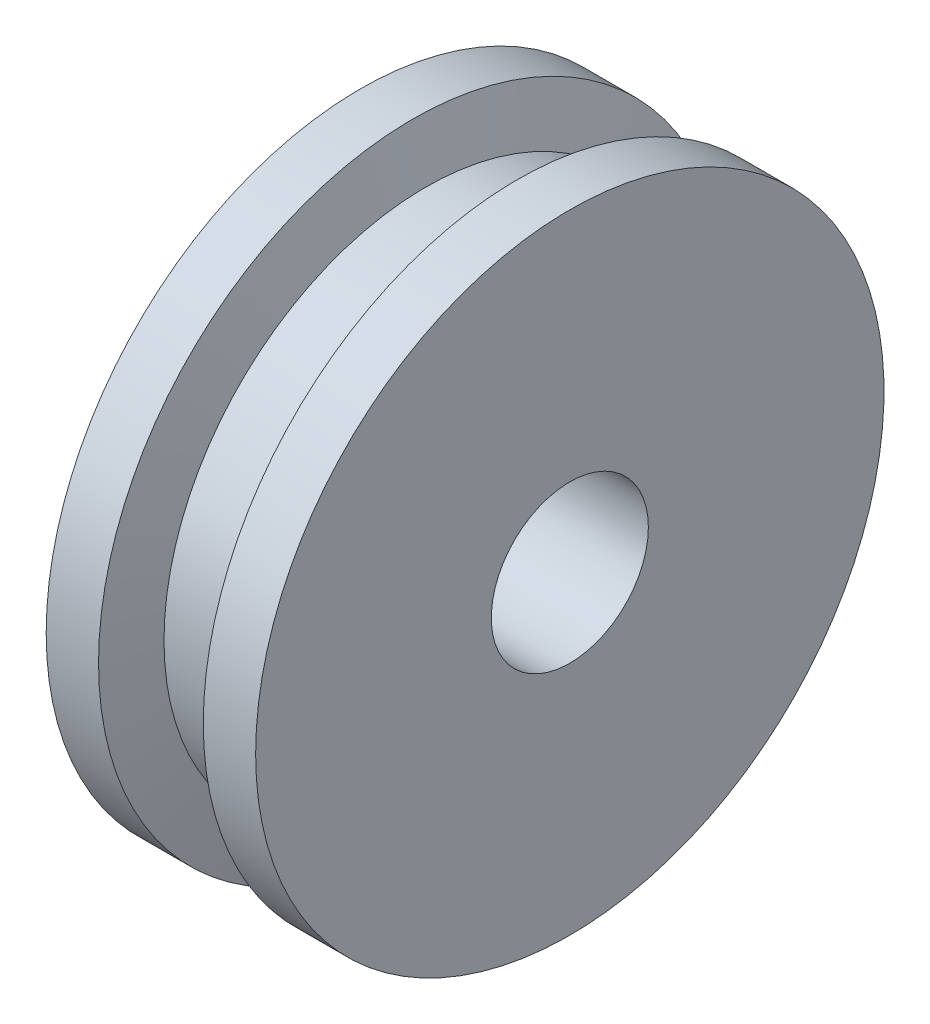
ISO-10303-21;
HEADER;
FILE_DESCRIPTION(('STEP AP214'),'2;1');
FILE_NAME('part.step','',(''),(''),'','','');
FILE_SCHEMA(('AUTOMOTIVE_DESIGN { 1 0 10303 214 1 1 1 1 }'));
ENDSEC;
DATA;
#1=APPLICATION_CONTEXT('core data for automotive mechanical design processes');
#2=APPLICATION_PROTOCOL_DEFINITION('international standard','automotive_design',2000,#1);
#3=PRODUCT_CONTEXT('',#1,'mechanical');
#4=PRODUCT('Part','Part','',(#3));
#5=PRODUCT_RELATED_PRODUCT_CATEGORY('part','',(#4));
#6=PRODUCT_DEFINITION_FORMATION('','',#4);
#7=PRODUCT_DEFINITION_CONTEXT('part definition',#1,'design');
#8=PRODUCT_DEFINITION('design','',#6,#7);
#9=PRODUCT_DEFINITION_SHAPE('','',#8);
#10=(LENGTH_UNIT() NAMED_UNIT(*) SI_UNIT(.MILLI.,.METRE.));
#11=(NAMED_UNIT(*) PLANE_ANGLE_UNIT() SI_UNIT($,.RADIAN.));
#12=(NAMED_UNIT(*) SI_UNIT($,.STERADIAN.) SOLID_ANGLE_UNIT());
#13=UNCERTAINTY_MEASURE_WITH_UNIT(LENGTH_MEASURE(1.E-05),#10,'distance_accuracy_value','');
#14=(GEOMETRIC_REPRESENTATION_CONTEXT(3) GLOBAL_UNCERTAINTY_ASSIGNED_CONTEXT((#13)) GLOBAL_UNIT_ASSIGNED_CONTEXT((#10,
#11,#12)) REPRESENTATION_CONTEXT('',''));
#15=CARTESIAN_POINT('',(0.,0.,0.));
#16=DIRECTION('',(0.,0.,1.));
#17=DIRECTION('',(1.,0.,0.));
#18=AXIS2_PLACEMENT_3D('',#15,#16,#17);
#19=CARTESIAN_POINT('',(-4.,0.,0.));
#20=DIRECTION('',(1.,0.,0.));
#21=DIRECTION('',(0.,0.,-1.));
#22=AXIS2_PLACEMENT_3D('',#19,#20,#21);
#23=PLANE('',#22);
#24=CARTESIAN_POINT('',(-4.,0.,0.));
#25=DIRECTION('',(1.,0.,0.));
#26=DIRECTION('',(0.,0.,-1.));
#27=AXIS2_PLACEMENT_3D('',#24,#25,#26);
#28=CIRCLE('',#27,3.);
#29=CARTESIAN_POINT('',(-4.,0.,-3.));
#30=VERTEX_POINT('',#29);
#31=EDGE_CURVE('E57',#30,#30,#28,.T.);
#32=ORIENTED_EDGE('',*,*,#31,.T.);
#33=EDGE_LOOP('',(#32));
#34=FACE_BOUND('',#33,.T.);
#35=CARTESIAN_POINT('',(-4.,0.,0.));
#36=DIRECTION('',(-1.,0.,0.));
#37=DIRECTION('',(0.,0.,1.));
#38=AXIS2_PLACEMENT_3D('',#35,#36,#37);
#39=CIRCLE('',#38,12.);
#40=CARTESIAN_POINT('',(-4.,0.,12.));
#41=VERTEX_POINT('',#40);
#42=EDGE_CURVE('E10',#41,#41,#39,.T.);
#43=ORIENTED_EDGE('',*,*,#42,.T.);
#44=EDGE_LOOP('',(#43));
#45=FACE_BOUND('',#44,.T.);
#46=ADVANCED_FACE('F32',(#34,#45),#23,.F.);
#47=CARTESIAN_POINT('',(-12.9632642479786,0.,0.));
#48=DIRECTION('',(-1.,0.,0.));
#49=DIRECTION('',(0.,0.,1.));
#50=AXIS2_PLACEMENT_3D('',#47,#48,#49);
#51=CYLINDRICAL_SURFACE('',#50,12.);
#52=ORIENTED_EDGE('',*,*,#42,.F.);
#53=EDGE_LOOP('',(#52));
#54=FACE_BOUND('',#53,.T.);
#55=CARTESIAN_POINT('',(-2.,0.,0.));
#56=DIRECTION('',(-1.,0.,0.));
#57=DIRECTION('',(0.,0.,1.));
#58=AXIS2_PLACEMENT_3D('',#55,#56,#57);
#59=CIRCLE('',#58,12.);
#60=CARTESIAN_POINT('',(-2.,0.,12.));
#61=VERTEX_POINT('',#60);
#62=EDGE_CURVE('E38',#61,#61,#59,.T.);
#63=ORIENTED_EDGE('',*,*,#62,.T.);
#64=EDGE_LOOP('',(#63));
#65=FACE_BOUND('',#64,.T.);
#66=ADVANCED_FACE('F90',(#54,#65),#51,.T.);
#67=CARTESIAN_POINT('',(-1.5,0.,0.));
#68=DIRECTION('',(-1.,0.,0.));
#69=DIRECTION('',(0.,0.,1.));
#70=AXIS2_PLACEMENT_3D('',#67,#68,#69);
#71=CONICAL_SURFACE('',#70,10.,1.32581766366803);
#72=ORIENTED_EDGE('',*,*,#62,.F.);
#73=EDGE_LOOP('',(#72));
#74=FACE_BOUND('',#73,.T.);
#75=CARTESIAN_POINT('',(-1.5,0.,0.));
#76=DIRECTION('',(-1.,0.,0.));
#77=DIRECTION('',(0.,0.,1.));
#78=AXIS2_PLACEMENT_3D('',#75,#76,#77);
#79=CIRCLE('',#78,10.);
#80=CARTESIAN_POINT('',(-1.5,0.,10.));
#81=VERTEX_POINT('',#80);
#82=EDGE_CURVE('E42',#81,#81,#79,.T.);
#83=ORIENTED_EDGE('',*,*,#82,.T.);
#84=EDGE_LOOP('',(#83));
#85=FACE_BOUND('',#84,.T.);
#86=ADVANCED_FACE('F94',(#74,#85),#71,.T.);
#87=CARTESIAN_POINT('',(-12.9632642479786,0.,0.));
#88=DIRECTION('',(-1.,0.,0.));
#89=DIRECTION('',(0.,0.,1.));
#90=AXIS2_PLACEMENT_3D('',#87,#88,#89);
#91=CYLINDRICAL_SURFACE('',#90,10.);
#92=ORIENTED_EDGE('',*,*,#82,.F.);
#93=EDGE_LOOP('',(#92));
#94=FACE_BOUND('',#93,.T.);
#95=CARTESIAN_POINT('',(1.5,0.,0.));
#96=DIRECTION('',(-1.,0.,0.));
#97=DIRECTION('',(0.,0.,1.));
#98=AXIS2_PLACEMENT_3D('',#95,#96,#97);
#99=CIRCLE('',#98,10.);
#100=CARTESIAN_POINT('',(1.5,0.,10.));
#101=VERTEX_POINT('',#100);
#102=EDGE_CURVE('E46',#101,#101,#99,.T.);
#103=ORIENTED_EDGE('',*,*,#102,.T.);
#104=EDGE_LOOP('',(#103));
#105=FACE_BOUND('',#104,.T.);
#106=ADVANCED_FACE('F85',(#94,#105),#91,.T.);
#107=CARTESIAN_POINT('',(2.,0.,0.));
#108=DIRECTION('',(1.,0.,0.));
#109=DIRECTION('',(0.,0.,-1.));
#110=AXIS2_PLACEMENT_3D('',#107,#108,#109);
#111=CONICAL_SURFACE('',#110,12.,1.32581766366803);
#112=ORIENTED_EDGE('',*,*,#102,.F.);
#113=EDGE_LOOP('',(#112));
#114=FACE_BOUND('',#113,.T.);
#115=CARTESIAN_POINT('',(2.,0.,0.));
#116=DIRECTION('',(-1.,0.,0.));
#117=DIRECTION('',(0.,0.,1.));
#118=AXIS2_PLACEMENT_3D('',#115,#116,#117);
#119=CIRCLE('',#118,12.);
#120=CARTESIAN_POINT('',(2.,0.,12.));
#121=VERTEX_POINT('',#120);
#122=EDGE_CURVE('E51',#121,#121,#119,.T.);
#123=ORIENTED_EDGE('',*,*,#122,.T.);
#124=EDGE_LOOP('',(#123));
#125=FACE_BOUND('',#124,.T.);
#126=ADVANCED_FACE('F79',(#114,#125),#111,.T.);
#127=CARTESIAN_POINT('',(-12.9632642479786,0.,0.));
#128=DIRECTION('',(-1.,0.,0.));
#129=DIRECTION('',(0.,0.,1.));
#130=AXIS2_PLACEMENT_3D('',#127,#128,#129);
#131=CYLINDRICAL_SURFACE('',#130,12.);
#132=ORIENTED_EDGE('',*,*,#122,.F.);
#133=EDGE_LOOP('',(#132));
#134=FACE_BOUND('',#133,.T.);
#135=CARTESIAN_POINT('',(4.,0.,0.));
#136=DIRECTION('',(-1.,0.,0.));
#137=DIRECTION('',(0.,0.,1.));
#138=AXIS2_PLACEMENT_3D('',#135,#136,#137);
#139=CIRCLE('',#138,12.);
#140=CARTESIAN_POINT('',(4.,0.,12.));
#141=VERTEX_POINT('',#140);
#142=EDGE_CURVE('E54',#141,#141,#139,.T.);
#143=ORIENTED_EDGE('',*,*,#142,.T.);
#144=EDGE_LOOP('',(#143));
#145=FACE_BOUND('',#144,.T.);
#146=ADVANCED_FACE('F74',(#134,#145),#131,.T.);
#147=CARTESIAN_POINT('',(4.,0.,0.));
#148=DIRECTION('',(-1.,0.,0.));
#149=DIRECTION('',(0.,0.,1.));
#150=AXIS2_PLACEMENT_3D('',#147,#148,#149);
#151=PLANE('',#150);
#152=CARTESIAN_POINT('',(4.,0.,0.));
#153=DIRECTION('',(1.,0.,0.));
#154=DIRECTION('',(0.,0.,-1.));
#155=AXIS2_PLACEMENT_3D('',#152,#153,#154);
#156=CIRCLE('',#155,3.);
#157=CARTESIAN_POINT('',(4.,0.,-3.));
#158=VERTEX_POINT('',#157);
#159=EDGE_CURVE('E58',#158,#158,#156,.T.);
#160=ORIENTED_EDGE('',*,*,#159,.F.);
#161=EDGE_LOOP('',(#160));
#162=FACE_BOUND('',#161,.T.);
#163=ORIENTED_EDGE('',*,*,#142,.F.);
#164=EDGE_LOOP('',(#163));
#165=FACE_BOUND('',#164,.T.);
#166=ADVANCED_FACE('F68',(#162,#165),#151,.F.);
#167=CARTESIAN_POINT('',(-4.,0.,0.));
#168=DIRECTION('',(1.,0.,0.));
#169=DIRECTION('',(0.,0.,-1.));
#170=AXIS2_PLACEMENT_3D('',#167,#168,#169);
#171=CYLINDRICAL_SURFACE('',#170,3.);
#172=ORIENTED_EDGE('',*,*,#31,.F.);
#173=EDGE_LOOP('',(#172));
#174=FACE_BOUND('',#173,.T.);
#175=ORIENTED_EDGE('',*,*,#159,.T.);
#176=EDGE_LOOP('',(#175));
#177=FACE_BOUND('',#176,.T.);
#178=ADVANCED_FACE('F65',(#174,#177),#171,.F.);
#179=CLOSED_SHELL('',(#46,#66,#86,#106,#126,#146,#166,#178));
#180=MANIFOLD_SOLID_BREP('B2',#179);
#181=ADVANCED_BREP_SHAPE_REPRESENTATION('',(#18,#180),#14);
#182=SHAPE_DEFINITION_REPRESENTATION(#9,#181);
ENDSEC;
END-ISO-10303-21;
